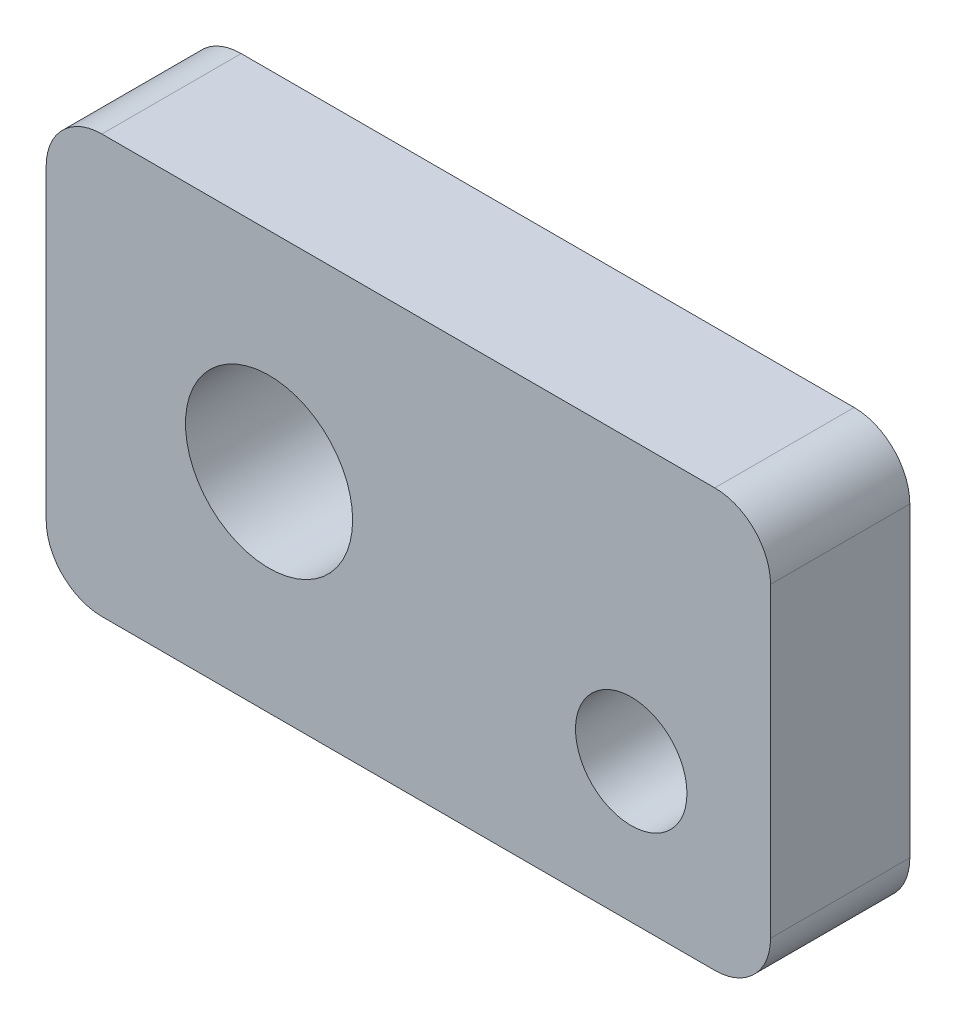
from build123d import *

# Parameters (mm, degrees)
ESQUISSE1_W        = 26
ESQUISSE1_H        = 15
ESQUISSE1_R        = 3
ESQUISSE1_R_2      = 2
BOSS_EXTRU_1_DEPTH = 5
CONG_1_R           = 2


with BuildPart() as part:
    # Esquisse1 → Boss.-Extru.1 (new body)
    with BuildSketch(Plane.XY):
        Rectangle(ESQUISSE1_W, ESQUISSE1_H)
        with Locations((-5, 0)):
            Circle(ESQUISSE1_R, mode=Mode.SUBTRACT)
        with Locations((8, -2.5)):
            Circle(ESQUISSE1_R_2, mode=Mode.SUBTRACT)
    extrude(amount=BOSS_EXTRU_1_DEPTH)

    # Cong_1
    cong_1_edges = [part.edges().sort_by_distance(p)[0] for p in [
        (13, -7.5, 2.5),
        (-13, -7.5, 2.5),
        (-13, 7.5, 2.5),
        (13, 7.5, 2.5),
    ]]
    fillet(cong_1_edges, radius=CONG_1_R)


solid = part.part
